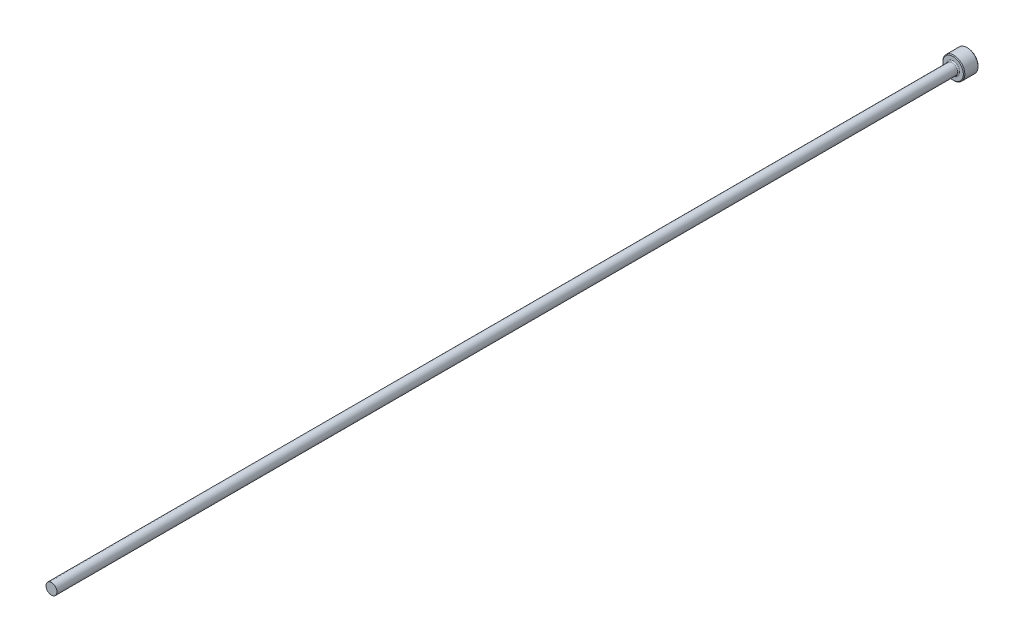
from build123d import *

# Parameters (mm, degrees)
CHAMFER1_SIZE = 0.2


with BuildPart() as part:
    # Sketch1 → Revolve1 (revolve)
    with BuildSketch(Plane(origin=(0, 0, 0), x_dir=(0, 0, -1), z_dir=(1, 0, 0)), mode=Mode.PRIVATE) as revolve1_sk:
        with BuildLine():
            Line((0, 0), (0, 3))
            Line((0, 3), (-4, 3))
            Line((-4, 3), (-4, 1.8))
            ThreePointArc((-4, 1.8), (-4.087867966, 1.587867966), (-4.3, 1.5))
            Line((-4.3, 1.5), (-250, 1.5))
            Line((-250, 1.5), (-250, 0))
            Line((-250, 0), (0, 0))
        make_face()
    revolve(revolve1_sk.sketch.rotate(Axis((0, 0, 109.05062828), (0, 0, -1)), 90), axis=Axis((0, 0, 109.05062828), (0, 0, -1)))

    # Chamfer1
    chamfer1_edges = [part.edges().sort_by_distance(p)[0] for p in [
        (-3, 0, 0),
        (-3, 0, 4),
    ]]
    chamfer(chamfer1_edges, length=CHAMFER1_SIZE)


solid = part.part
